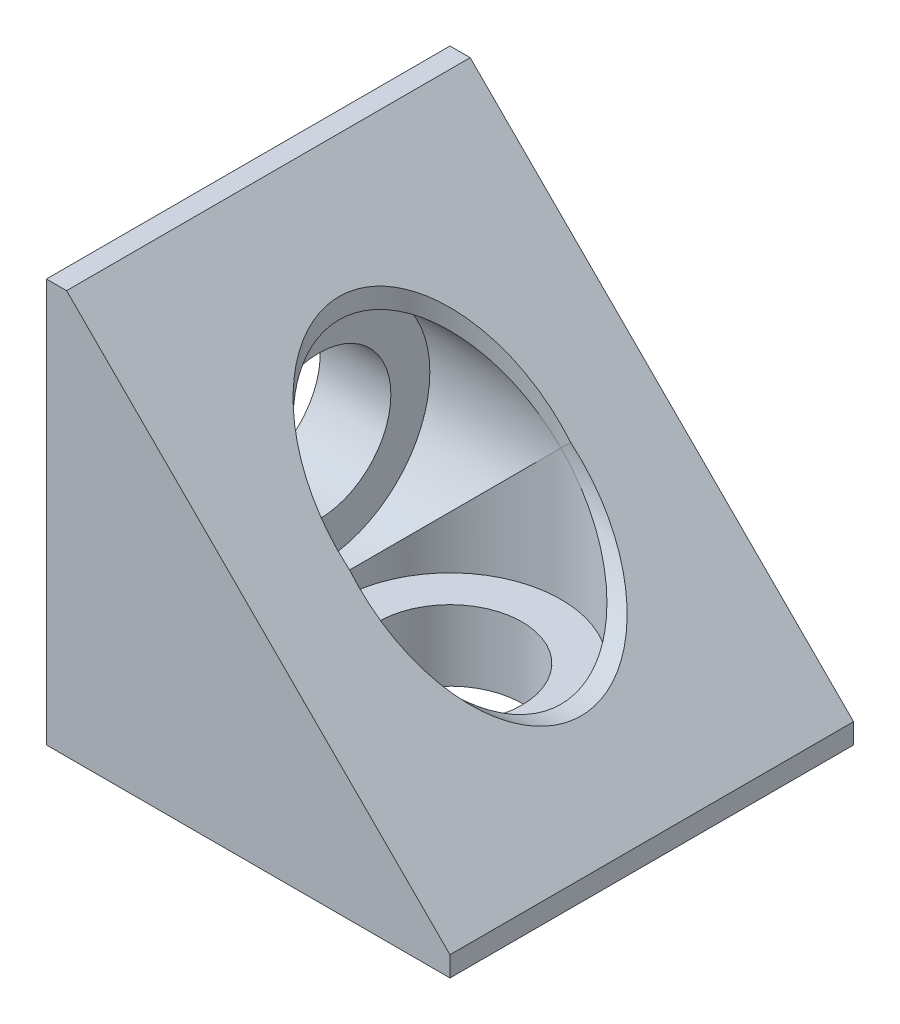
ISO-10303-21;
HEADER;
FILE_DESCRIPTION(('STEP AP214'),'2;1');
FILE_NAME('part.step','',(''),(''),'','','');
FILE_SCHEMA(('AUTOMOTIVE_DESIGN { 1 0 10303 214 1 1 1 1 }'));
ENDSEC;
DATA;
#1=APPLICATION_CONTEXT('core data for automotive mechanical design processes');
#2=APPLICATION_PROTOCOL_DEFINITION('international standard','automotive_design',2000,#1);
#3=PRODUCT_CONTEXT('',#1,'mechanical');
#4=PRODUCT('Part','Part','',(#3));
#5=PRODUCT_RELATED_PRODUCT_CATEGORY('part','',(#4));
#6=PRODUCT_DEFINITION_FORMATION('','',#4);
#7=PRODUCT_DEFINITION_CONTEXT('part definition',#1,'design');
#8=PRODUCT_DEFINITION('design','',#6,#7);
#9=PRODUCT_DEFINITION_SHAPE('','',#8);
#10=(LENGTH_UNIT() NAMED_UNIT(*) SI_UNIT(.MILLI.,.METRE.));
#11=(NAMED_UNIT(*) PLANE_ANGLE_UNIT() SI_UNIT($,.RADIAN.));
#12=(NAMED_UNIT(*) SI_UNIT($,.STERADIAN.) SOLID_ANGLE_UNIT());
#13=UNCERTAINTY_MEASURE_WITH_UNIT(LENGTH_MEASURE(1.E-05),#10,'distance_accuracy_value','');
#14=(GEOMETRIC_REPRESENTATION_CONTEXT(3) GLOBAL_UNCERTAINTY_ASSIGNED_CONTEXT((#13)) GLOBAL_UNIT_ASSIGNED_CONTEXT((#10,
#11,#12)) REPRESENTATION_CONTEXT('',''));
#15=CARTESIAN_POINT('',(0.,0.,0.));
#16=DIRECTION('',(0.,0.,1.));
#17=DIRECTION('',(1.,0.,0.));
#18=AXIS2_PLACEMENT_3D('',#15,#16,#17);
#19=CARTESIAN_POINT('',(10.,20.,10.));
#20=DIRECTION('',(0.,-1.,0.));
#21=DIRECTION('',(1.,0.,0.));
#22=AXIS2_PLACEMENT_3D('',#19,#20,#21);
#23=CYLINDRICAL_SURFACE('',#22,3.57);
#24=CARTESIAN_POINT('',(10.,0.,10.));
#25=DIRECTION('',(0.,-1.,0.));
#26=DIRECTION('',(1.,0.,0.));
#27=AXIS2_PLACEMENT_3D('',#24,#25,#26);
#28=CIRCLE('',#27,3.57);
#29=CARTESIAN_POINT('',(13.57,0.,10.));
#30=VERTEX_POINT('',#29);
#31=EDGE_CURVE('E175',#30,#30,#28,.T.);
#32=ORIENTED_EDGE('',*,*,#31,.T.);
#33=EDGE_LOOP('',(#32));
#34=FACE_BOUND('',#33,.T.);
#35=CARTESIAN_POINT('',(10.,3.5,10.));
#36=DIRECTION('',(0.,1.,0.));
#37=DIRECTION('',(0.,0.,1.));
#38=AXIS2_PLACEMENT_3D('',#35,#36,#37);
#39=CIRCLE('',#38,3.57);
#40=CARTESIAN_POINT('',(10.,3.5,13.57));
#41=VERTEX_POINT('',#40);
#42=EDGE_CURVE('E38',#41,#41,#39,.F.);
#43=ORIENTED_EDGE('',*,*,#42,.F.);
#44=EDGE_LOOP('',(#43));
#45=FACE_BOUND('',#44,.T.);
#46=ADVANCED_FACE('F34',(#34,#45),#23,.F.);
#47=CARTESIAN_POINT('',(3.5,10.,10.));
#48=DIRECTION('',(1.,0.,0.));
#49=DIRECTION('',(0.,0.,-1.));
#50=AXIS2_PLACEMENT_3D('',#47,#48,#49);
#51=CYLINDRICAL_SURFACE('',#50,5.5);
#52=CARTESIAN_POINT('',(10.,10.,10.));
#53=DIRECTION('',(0.707106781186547,0.707106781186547,0.));
#54=DIRECTION('',(0.707106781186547,-0.707106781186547,0.));
#55=AXIS2_PLACEMENT_3D('',#52,#53,#54);
#56=ELLIPSE('',#55,7.77817459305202,5.5);
#57=CARTESIAN_POINT('',(10.,10.,4.5));
#58=VERTEX_POINT('',#57);
#59=CARTESIAN_POINT('',(10.,10.,15.5));
#60=VERTEX_POINT('',#59);
#61=EDGE_CURVE('E43',#58,#60,#56,.F.);
#62=ORIENTED_EDGE('',*,*,#61,.T.);
#63=CARTESIAN_POINT('',(10.,10.,10.));
#64=DIRECTION('',(0.707106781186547,-0.707106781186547,0.));
#65=DIRECTION('',(0.707106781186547,0.707106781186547,0.));
#66=AXIS2_PLACEMENT_3D('',#63,#64,#65);
#67=ELLIPSE('',#66,7.77817459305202,5.5);
#68=CARTESIAN_POINT('',(10.5000203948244,10.5000203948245,15.4772237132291));
#69=VERTEX_POINT('',#68);
#70=EDGE_CURVE('E11',#60,#69,#67,.F.);
#71=ORIENTED_EDGE('',*,*,#70,.T.);
#72=CARTESIAN_POINT('',(11.0000429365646,10.,10.));
#73=DIRECTION('',(-0.707105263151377,-0.707108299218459,0.));
#74=DIRECTION('',(0.707108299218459,-0.707105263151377,0.));
#75=AXIS2_PLACEMENT_3D('',#72,#73,#74);
#76=ELLIPSE('',#75,7.77819129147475,5.5);
#77=CARTESIAN_POINT('',(10.5000203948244,10.5000203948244,4.52277628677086));
#78=VERTEX_POINT('',#77);
#79=EDGE_CURVE('E173',#78,#69,#76,.T.);
#80=ORIENTED_EDGE('',*,*,#79,.F.);
#81=EDGE_CURVE('E45',#78,#58,#67,.F.);
#82=ORIENTED_EDGE('',*,*,#81,.T.);
#83=EDGE_LOOP('',(#62,#71,#80,#82));
#84=FACE_BOUND('',#83,.T.);
#85=ADVANCED_FACE('F147',(#84),#51,.F.);
#86=CARTESIAN_POINT('',(20.,10.,10.));
#87=DIRECTION('',(-1.,0.,0.));
#88=DIRECTION('',(0.,0.,1.));
#89=AXIS2_PLACEMENT_3D('',#86,#87,#88);
#90=CYLINDRICAL_SURFACE('',#89,3.57);
#91=CARTESIAN_POINT('',(0.,10.,10.));
#92=DIRECTION('',(-1.,0.,0.));
#93=DIRECTION('',(0.,0.,1.));
#94=AXIS2_PLACEMENT_3D('',#91,#92,#93);
#95=CIRCLE('',#94,3.57);
#96=CARTESIAN_POINT('',(0.,10.,13.57));
#97=VERTEX_POINT('',#96);
#98=EDGE_CURVE('E128',#97,#97,#95,.T.);
#99=ORIENTED_EDGE('',*,*,#98,.T.);
#100=EDGE_LOOP('',(#99));
#101=FACE_BOUND('',#100,.T.);
#102=CARTESIAN_POINT('',(3.5,10.,10.));
#103=DIRECTION('',(1.,0.,0.));
#104=DIRECTION('',(0.,0.,-1.));
#105=AXIS2_PLACEMENT_3D('',#102,#103,#104);
#106=CIRCLE('',#105,3.57);
#107=CARTESIAN_POINT('',(3.5,10.,6.43));
#108=VERTEX_POINT('',#107);
#109=EDGE_CURVE('E164',#108,#108,#106,.T.);
#110=ORIENTED_EDGE('',*,*,#109,.T.);
#111=EDGE_LOOP('',(#110));
#112=FACE_BOUND('',#111,.T.);
#113=ADVANCED_FACE('F205',(#101,#112),#90,.F.);
#114=CARTESIAN_POINT('',(20.,0.,20.));
#115=DIRECTION('',(0.,1.,0.));
#116=DIRECTION('',(-1.,0.,0.));
#117=AXIS2_PLACEMENT_3D('',#114,#115,#116);
#118=PLANE('',#117);
#119=ORIENTED_EDGE('',*,*,#31,.F.);
#120=EDGE_LOOP('',(#119));
#121=FACE_BOUND('',#120,.T.);
#122=DIRECTION('',(1.,0.,0.));
#123=VECTOR('',#122,1.);
#124=CARTESIAN_POINT('',(20.,0.,0.));
#125=LINE('',#124,#123);
#126=CARTESIAN_POINT('',(0.,0.,0.));
#127=VERTEX_POINT('',#126);
#128=CARTESIAN_POINT('',(20.,0.,0.));
#129=VERTEX_POINT('',#128);
#130=EDGE_CURVE('E124',#127,#129,#125,.T.);
#131=ORIENTED_EDGE('',*,*,#130,.T.);
#132=DIRECTION('',(0.,0.,-1.));
#133=VECTOR('',#132,1.);
#134=CARTESIAN_POINT('',(20.,0.,20.));
#135=LINE('',#134,#133);
#136=CARTESIAN_POINT('',(20.,0.,20.));
#137=VERTEX_POINT('',#136);
#138=EDGE_CURVE('E138',#137,#129,#135,.T.);
#139=ORIENTED_EDGE('',*,*,#138,.F.);
#140=DIRECTION('',(1.,0.,0.));
#141=VECTOR('',#140,1.);
#142=CARTESIAN_POINT('',(20.,0.,20.));
#143=LINE('',#142,#141);
#144=CARTESIAN_POINT('',(0.,0.,20.));
#145=VERTEX_POINT('',#144);
#146=EDGE_CURVE('E134',#145,#137,#143,.T.);
#147=ORIENTED_EDGE('',*,*,#146,.F.);
#148=DIRECTION('',(0.,0.,-1.));
#149=VECTOR('',#148,1.);
#150=CARTESIAN_POINT('',(0.,0.,20.));
#151=LINE('',#150,#149);
#152=EDGE_CURVE('E120',#145,#127,#151,.T.);
#153=ORIENTED_EDGE('',*,*,#152,.T.);
#154=EDGE_LOOP('',(#131,#139,#147,#153));
#155=FACE_BOUND('',#154,.T.);
#156=ADVANCED_FACE('F36',(#121,#155),#118,.F.);
#157=CARTESIAN_POINT('',(20.,1.0000815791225,20.));
#158=DIRECTION('',(-1.,0.,0.));
#159=DIRECTION('',(0.,0.,1.));
#160=AXIS2_PLACEMENT_3D('',#157,#158,#159);
#161=PLANE('',#160);
#162=DIRECTION('',(0.,1.,0.));
#163=VECTOR('',#162,1.);
#164=CARTESIAN_POINT('',(20.,1.0000815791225,0.));
#165=LINE('',#164,#163);
#166=CARTESIAN_POINT('',(20.,1.0000815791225,0.));
#167=VERTEX_POINT('',#166);
#168=EDGE_CURVE('E127',#129,#167,#165,.T.);
#169=ORIENTED_EDGE('',*,*,#168,.T.);
#170=DIRECTION('',(0.,0.,-1.));
#171=VECTOR('',#170,1.);
#172=CARTESIAN_POINT('',(20.,1.0000815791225,20.));
#173=LINE('',#172,#171);
#174=CARTESIAN_POINT('',(20.,1.0000815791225,20.));
#175=VERTEX_POINT('',#174);
#176=EDGE_CURVE('E115',#175,#167,#173,.T.);
#177=ORIENTED_EDGE('',*,*,#176,.F.);
#178=DIRECTION('',(0.,1.,0.));
#179=VECTOR('',#178,1.);
#180=CARTESIAN_POINT('',(20.,1.0000815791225,20.));
#181=LINE('',#180,#179);
#182=EDGE_CURVE('E93',#137,#175,#181,.T.);
#183=ORIENTED_EDGE('',*,*,#182,.F.);
#184=ORIENTED_EDGE('',*,*,#138,.T.);
#185=EDGE_LOOP('',(#169,#177,#183,#184));
#186=FACE_BOUND('',#185,.T.);
#187=ADVANCED_FACE('F184',(#186),#161,.F.);
#188=CARTESIAN_POINT('',(1.,20.,20.));
#189=DIRECTION('',(-0.707105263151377,-0.707108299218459,0.));
#190=DIRECTION('',(0.707108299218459,-0.707105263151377,0.));
#191=AXIS2_PLACEMENT_3D('',#188,#189,#190);
#192=PLANE('',#191);
#193=ORIENTED_EDGE('',*,*,#79,.T.);
#194=CARTESIAN_POINT('',(10.,11.0000386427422,10.));
#195=DIRECTION('',(-0.707105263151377,-0.707108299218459,0.));
#196=DIRECTION('',(-0.707108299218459,0.707105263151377,0.));
#197=AXIS2_PLACEMENT_3D('',#194,#195,#196);
#198=ELLIPSE('',#197,7.77815789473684,5.5);
#199=EDGE_CURVE('E159',#69,#78,#198,.T.);
#200=ORIENTED_EDGE('',*,*,#199,.T.);
#201=EDGE_LOOP('',(#193,#200));
#202=FACE_BOUND('',#201,.T.);
#203=DIRECTION('',(-0.707108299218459,0.707105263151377,0.));
#204=VECTOR('',#203,1.);
#205=CARTESIAN_POINT('',(1.,20.,0.));
#206=LINE('',#205,#204);
#207=CARTESIAN_POINT('',(1.,20.,0.));
#208=VERTEX_POINT('',#207);
#209=EDGE_CURVE('E112',#167,#208,#206,.T.);
#210=ORIENTED_EDGE('',*,*,#209,.T.);
#211=DIRECTION('',(0.,0.,-1.));
#212=VECTOR('',#211,1.);
#213=CARTESIAN_POINT('',(1.,20.,20.));
#214=LINE('',#213,#212);
#215=CARTESIAN_POINT('',(1.,20.,20.));
#216=VERTEX_POINT('',#215);
#217=EDGE_CURVE('E109',#216,#208,#214,.T.);
#218=ORIENTED_EDGE('',*,*,#217,.F.);
#219=DIRECTION('',(-0.707108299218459,0.707105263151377,0.));
#220=VECTOR('',#219,1.);
#221=CARTESIAN_POINT('',(1.,20.,20.));
#222=LINE('',#221,#220);
#223=EDGE_CURVE('E99',#175,#216,#222,.T.);
#224=ORIENTED_EDGE('',*,*,#223,.F.);
#225=ORIENTED_EDGE('',*,*,#176,.T.);
#226=EDGE_LOOP('',(#210,#218,#224,#225));
#227=FACE_BOUND('',#226,.T.);
#228=ADVANCED_FACE('F110',(#202,#227),#192,.F.);
#229=CARTESIAN_POINT('',(0.,20.,20.));
#230=DIRECTION('',(0.,-1.,0.));
#231=DIRECTION('',(0.,0.,-1.));
#232=AXIS2_PLACEMENT_3D('',#229,#230,#231);
#233=PLANE('',#232);
#234=DIRECTION('',(-1.,0.,0.));
#235=VECTOR('',#234,1.);
#236=CARTESIAN_POINT('',(0.,20.,0.));
#237=LINE('',#236,#235);
#238=CARTESIAN_POINT('',(0.,20.,0.));
#239=VERTEX_POINT('',#238);
#240=EDGE_CURVE('E131',#208,#239,#237,.T.);
#241=ORIENTED_EDGE('',*,*,#240,.T.);
#242=DIRECTION('',(0.,0.,-1.));
#243=VECTOR('',#242,1.);
#244=CARTESIAN_POINT('',(0.,20.,20.));
#245=LINE('',#244,#243);
#246=CARTESIAN_POINT('',(0.,20.,20.));
#247=VERTEX_POINT('',#246);
#248=EDGE_CURVE('E116',#247,#239,#245,.T.);
#249=ORIENTED_EDGE('',*,*,#248,.F.);
#250=DIRECTION('',(-1.,0.,0.));
#251=VECTOR('',#250,1.);
#252=CARTESIAN_POINT('',(0.,20.,20.));
#253=LINE('',#252,#251);
#254=EDGE_CURVE('E103',#216,#247,#253,.T.);
#255=ORIENTED_EDGE('',*,*,#254,.F.);
#256=ORIENTED_EDGE('',*,*,#217,.T.);
#257=EDGE_LOOP('',(#241,#249,#255,#256));
#258=FACE_BOUND('',#257,.T.);
#259=ADVANCED_FACE('F118',(#258),#233,.F.);
#260=CARTESIAN_POINT('',(0.,0.,20.));
#261=DIRECTION('',(1.,0.,0.));
#262=DIRECTION('',(0.,0.,-1.));
#263=AXIS2_PLACEMENT_3D('',#260,#261,#262);
#264=PLANE('',#263);
#265=ORIENTED_EDGE('',*,*,#98,.F.);
#266=EDGE_LOOP('',(#265));
#267=FACE_BOUND('',#266,.T.);
#268=DIRECTION('',(0.,-1.,0.));
#269=VECTOR('',#268,1.);
#270=CARTESIAN_POINT('',(0.,0.,0.));
#271=LINE('',#270,#269);
#272=EDGE_CURVE('E84',#239,#127,#271,.T.);
#273=ORIENTED_EDGE('',*,*,#272,.T.);
#274=ORIENTED_EDGE('',*,*,#152,.F.);
#275=DIRECTION('',(0.,-1.,0.));
#276=VECTOR('',#275,1.);
#277=CARTESIAN_POINT('',(0.,0.,20.));
#278=LINE('',#277,#276);
#279=EDGE_CURVE('E60',#247,#145,#278,.T.);
#280=ORIENTED_EDGE('',*,*,#279,.F.);
#281=ORIENTED_EDGE('',*,*,#248,.T.);
#282=EDGE_LOOP('',(#273,#274,#280,#281));
#283=FACE_BOUND('',#282,.T.);
#284=ADVANCED_FACE('F187',(#267,#283),#264,.F.);
#285=CARTESIAN_POINT('',(0.,0.,20.));
#286=DIRECTION('',(0.,0.,-1.));
#287=DIRECTION('',(-1.,0.,0.));
#288=AXIS2_PLACEMENT_3D('',#285,#286,#287);
#289=PLANE('',#288);
#290=ORIENTED_EDGE('',*,*,#146,.T.);
#291=ORIENTED_EDGE('',*,*,#182,.T.);
#292=ORIENTED_EDGE('',*,*,#223,.T.);
#293=ORIENTED_EDGE('',*,*,#254,.T.);
#294=ORIENTED_EDGE('',*,*,#279,.T.);
#295=EDGE_LOOP('',(#290,#291,#292,#293,#294));
#296=FACE_BOUND('',#295,.T.);
#297=ADVANCED_FACE('F101',(#296),#289,.F.);
#298=CARTESIAN_POINT('',(0.,0.,0.));
#299=DIRECTION('',(0.,0.,-1.));
#300=DIRECTION('',(-1.,0.,0.));
#301=AXIS2_PLACEMENT_3D('',#298,#299,#300);
#302=PLANE('',#301);
#303=ORIENTED_EDGE('',*,*,#130,.F.);
#304=ORIENTED_EDGE('',*,*,#272,.F.);
#305=ORIENTED_EDGE('',*,*,#240,.F.);
#306=ORIENTED_EDGE('',*,*,#209,.F.);
#307=ORIENTED_EDGE('',*,*,#168,.F.);
#308=EDGE_LOOP('',(#303,#304,#305,#306,#307));
#309=FACE_BOUND('',#308,.T.);
#310=ADVANCED_FACE('F186',(#309),#302,.T.);
#311=CARTESIAN_POINT('',(3.5,10.,10.));
#312=DIRECTION('',(1.,0.,0.));
#313=DIRECTION('',(0.,0.,-1.));
#314=AXIS2_PLACEMENT_3D('',#311,#312,#313);
#315=CIRCLE('',#314,5.5);
#316=CARTESIAN_POINT('',(3.5,10.,4.5));
#317=VERTEX_POINT('',#316);
#318=EDGE_CURVE('E170',#317,#317,#315,.T.);
#319=ORIENTED_EDGE('',*,*,#318,.F.);
#320=EDGE_LOOP('',(#319));
#321=FACE_BOUND('',#320,.T.);
#322=CARTESIAN_POINT('',(10.,10.,10.));
#323=DIRECTION('',(0.707106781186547,-0.707106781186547,0.));
#324=DIRECTION('',(0.707106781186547,0.707106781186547,0.));
#325=AXIS2_PLACEMENT_3D('',#322,#323,#324);
#326=ELLIPSE('',#325,7.77817459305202,5.5);
#327=EDGE_CURVE('E140',#60,#58,#326,.T.);
#328=ORIENTED_EDGE('',*,*,#327,.T.);
#329=CARTESIAN_POINT('',(10.,10.,10.));
#330=DIRECTION('',(0.707106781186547,0.707106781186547,0.));
#331=DIRECTION('',(0.707106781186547,-0.707106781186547,0.));
#332=AXIS2_PLACEMENT_3D('',#329,#330,#331);
#333=ELLIPSE('',#332,7.77817459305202,5.5);
#334=EDGE_CURVE('E143',#58,#60,#333,.T.);
#335=ORIENTED_EDGE('',*,*,#334,.T.);
#336=EDGE_LOOP('',(#328,#335));
#337=FACE_BOUND('',#336,.T.);
#338=ADVANCED_FACE('F154',(#321,#337),#51,.F.);
#339=CARTESIAN_POINT('',(3.5,4.13286057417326,-11.3685483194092));
#340=DIRECTION('',(1.,0.,0.));
#341=DIRECTION('',(0.,0.,-1.));
#342=AXIS2_PLACEMENT_3D('',#339,#340,#341);
#343=PLANE('',#342);
#344=ORIENTED_EDGE('',*,*,#109,.F.);
#345=EDGE_LOOP('',(#344));
#346=FACE_BOUND('',#345,.T.);
#347=ORIENTED_EDGE('',*,*,#318,.T.);
#348=EDGE_LOOP('',(#347));
#349=FACE_BOUND('',#348,.T.);
#350=ADVANCED_FACE('F216',(#346,#349),#343,.T.);
#351=CARTESIAN_POINT('',(10.,3.5,10.));
#352=DIRECTION('',(0.,1.,0.));
#353=DIRECTION('',(0.,0.,1.));
#354=AXIS2_PLACEMENT_3D('',#351,#352,#353);
#355=CYLINDRICAL_SURFACE('',#354,5.5);
#356=ORIENTED_EDGE('',*,*,#334,.F.);
#357=ORIENTED_EDGE('',*,*,#81,.F.);
#358=ORIENTED_EDGE('',*,*,#199,.F.);
#359=ORIENTED_EDGE('',*,*,#70,.F.);
#360=EDGE_LOOP('',(#356,#357,#358,#359));
#361=FACE_BOUND('',#360,.T.);
#362=ADVANCED_FACE('F156',(#361),#355,.F.);
#363=CARTESIAN_POINT('',(10.,3.5,10.));
#364=DIRECTION('',(0.,1.,0.));
#365=DIRECTION('',(0.,0.,1.));
#366=AXIS2_PLACEMENT_3D('',#363,#364,#365);
#367=PLANE('',#366);
#368=CARTESIAN_POINT('',(10.,3.5,10.));
#369=DIRECTION('',(0.,1.,0.));
#370=DIRECTION('',(0.,0.,1.));
#371=AXIS2_PLACEMENT_3D('',#368,#369,#370);
#372=CIRCLE('',#371,5.5);
#373=CARTESIAN_POINT('',(10.,3.5,15.5));
#374=VERTEX_POINT('',#373);
#375=EDGE_CURVE('E161',#374,#374,#372,.T.);
#376=ORIENTED_EDGE('',*,*,#375,.T.);
#377=EDGE_LOOP('',(#376));
#378=FACE_BOUND('',#377,.T.);
#379=ORIENTED_EDGE('',*,*,#42,.T.);
#380=EDGE_LOOP('',(#379));
#381=FACE_BOUND('',#380,.T.);
#382=ADVANCED_FACE('F227',(#378,#381),#367,.T.);
#383=ORIENTED_EDGE('',*,*,#375,.F.);
#384=EDGE_LOOP('',(#383));
#385=FACE_BOUND('',#384,.T.);
#386=ORIENTED_EDGE('',*,*,#327,.F.);
#387=ORIENTED_EDGE('',*,*,#61,.F.);
#388=EDGE_LOOP('',(#386,#387));
#389=FACE_BOUND('',#388,.T.);
#390=ADVANCED_FACE('F229',(#385,#389),#355,.F.);
#391=CLOSED_SHELL('',(#46,#85,#113,#156,#187,#228,#259,#284,#297,#310,#338,#350,#362,#382,#390));
#392=MANIFOLD_SOLID_BREP('B2',#391);
#393=ADVANCED_BREP_SHAPE_REPRESENTATION('',(#18,#392),#14);
#394=SHAPE_DEFINITION_REPRESENTATION(#9,#393);
ENDSEC;
END-ISO-10303-21;
